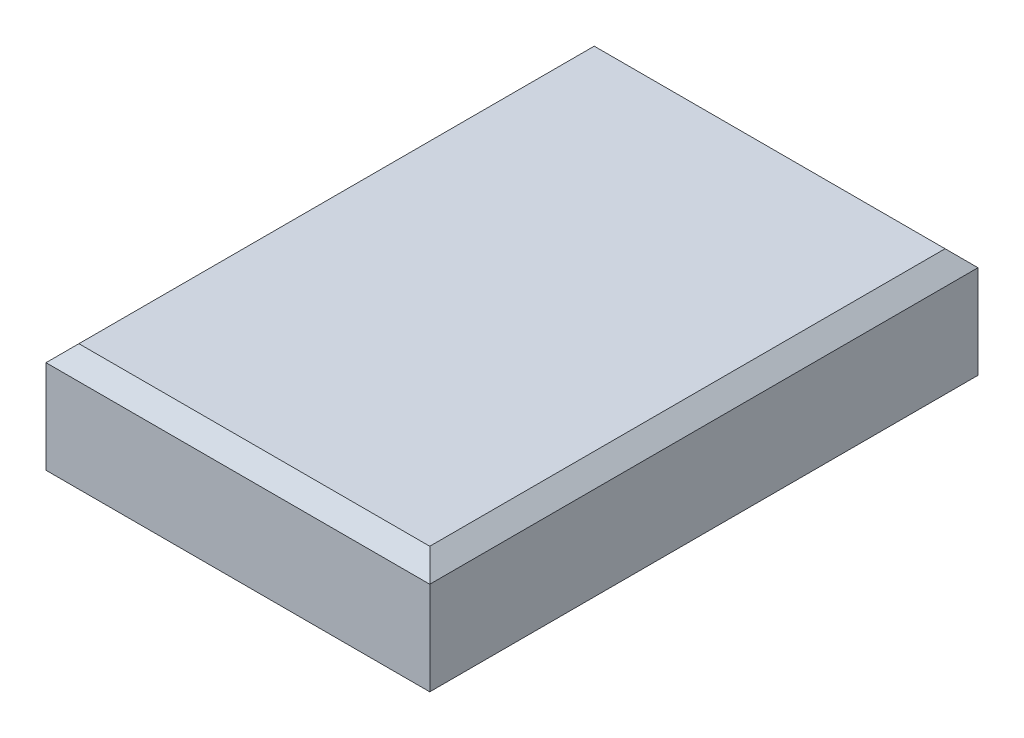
from build123d import *

# Parameters (mm, degrees)
SKETCH1_W           = 70
SKETCH1_H           = 100
BOSS_EXTRUDE1_DEPTH = 20
CHAMFER1_SIZE       = 3


with BuildPart() as part:
    # Sketch1 → Boss-Extrude1 (new body)
    with BuildSketch(Plane(origin=(0, 0, 0), x_dir=(1, 0, 0), z_dir=(0, 1, 0))):
        Rectangle(SKETCH1_W, SKETCH1_H)
    extrude(amount=BOSS_EXTRUDE1_DEPTH)

    # Chamfer1
    chamfer1_edges = [part.edges().sort_by_distance(p)[0] for p in [
        (-35, 20, 0),
        (0, 20, 50),
        (35, 20, 0),
        (0, 20, -50),
    ]]
    chamfer(chamfer1_edges, length=CHAMFER1_SIZE)


solid = part.part
